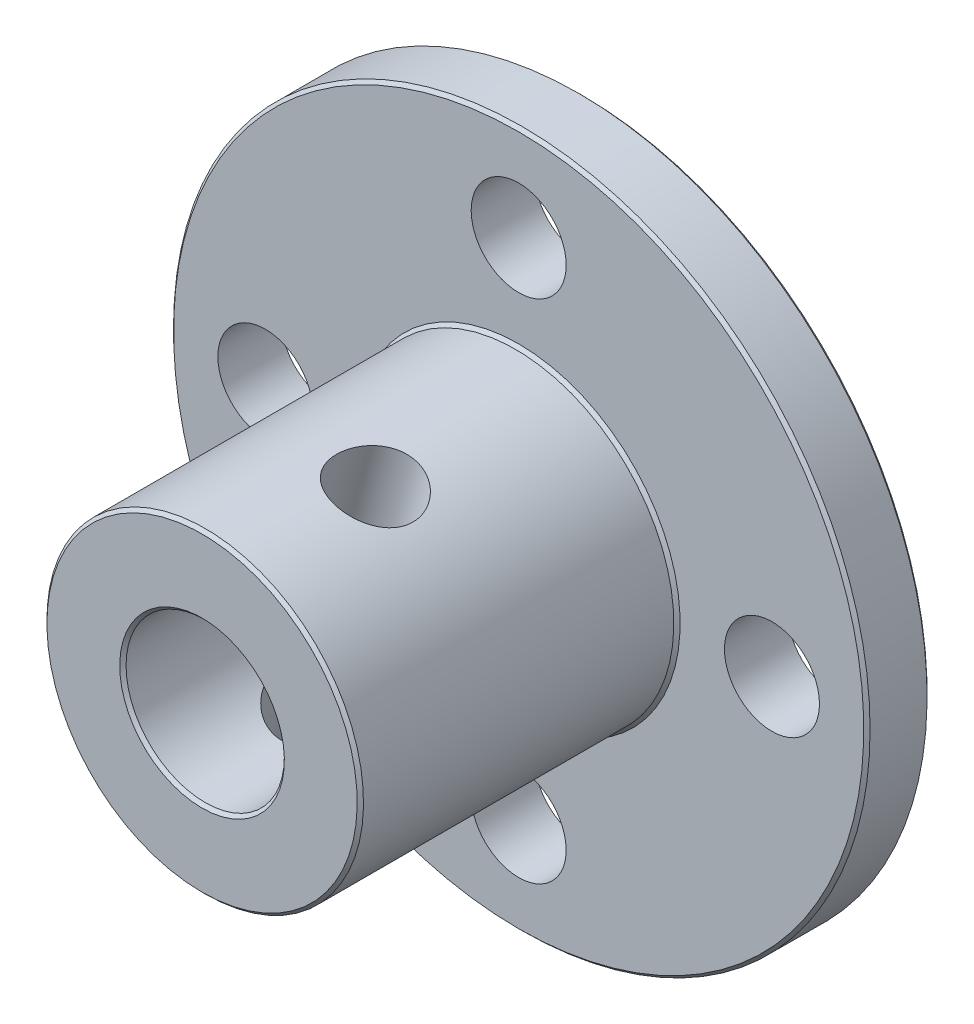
from build123d import *

# Parameters (mm, degrees)
FIRST_MOUNTING_HOLE_REACH   = 21.647
SKETCH2_R                   = 1.5
MOUNTING_HOLE_PATTERN_COUNT = 4
M3_SETSCREW_BORE_DEPTH      = 20.646882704
M3_SETSCREW_BORE_DEPTH_BACK = 20.646882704
SKETCH3_R                   = 1.25
CHAMFER1_SIZE               = 0.1


with BuildPart() as part:
    # Sketch1 → Revolve1 (revolve)
    with BuildSketch(Plane(origin=(0, 0, 0), x_dir=(0, 0, -1), z_dir=(1, 0, 0))):
        Polygon((-12, 2.5), (0, 2.5), (0, 11), (-2, 11), (-2, 5), (-12, 5), align=None)
    revolve(axis=Axis((0, 0, 0), (0, 0, 1)))

    # Sketch2 → first mounting hole (cut, up to next)
    with BuildSketch(Plane(origin=(0, 0, 0), x_dir=(-1, 0, 0), z_dir=(0, 0, -1)), mode=Mode.PRIVATE) as first_mounting_hole_sk1:
        with Locations(Location((0, 8, 0), (0, 0, 90))):
            Circle(SKETCH2_R)
    first_mounting_hole_tool1 = extrude(first_mounting_hole_sk1.sketch, amount=-FIRST_MOUNTING_HOLE_REACH, mode=Mode.PRIVATE) & part.part
    first_mounting_hole = first_mounting_hole_tool1.solids().sort_by_distance((0, 8, 0))[0]
    add(first_mounting_hole, mode=Mode.SUBTRACT)

    # mounting hole pattern: first mounting hole ×4 about axis
    mounting_hole_pattern_axis = Axis((0, 0, 0), (0, 0, 1))
    for i in range(1, MOUNTING_HOLE_PATTERN_COUNT):
        add(first_mounting_hole.rotate(mounting_hole_pattern_axis, i * 360 / MOUNTING_HOLE_PATTERN_COUNT), mode=Mode.SUBTRACT)

    # Sketch3 → M3 setscrew bore (cut, two sides: drawn at the far end of the back side and taken through both)
    with BuildSketch(Plane(origin=(0, 0, 0), x_dir=(0, 0, -1), z_dir=(0.25881904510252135, 0.9659258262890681, 0)).offset(-M3_SETSCREW_BORE_DEPTH_BACK)):
        with Locations(Location((-7.8, 0, 0), (0, 0, 90))):
            Circle(SKETCH3_R)
    extrude(amount=M3_SETSCREW_BORE_DEPTH + M3_SETSCREW_BORE_DEPTH_BACK, mode=Mode.SUBTRACT)

    # Chamfer1
    chamfer1_edges = [part.edges().sort_by_distance(p)[0] for p in [
        (0, -5, 12),
        (0, -5, 2),
        (0, -11, 2),
        (0, -11, 0),
        (0, -2.5, 0),
        (0, -2.5, 12),
    ]]
    chamfer(chamfer1_edges, length=CHAMFER1_SIZE)


solid = part.part
